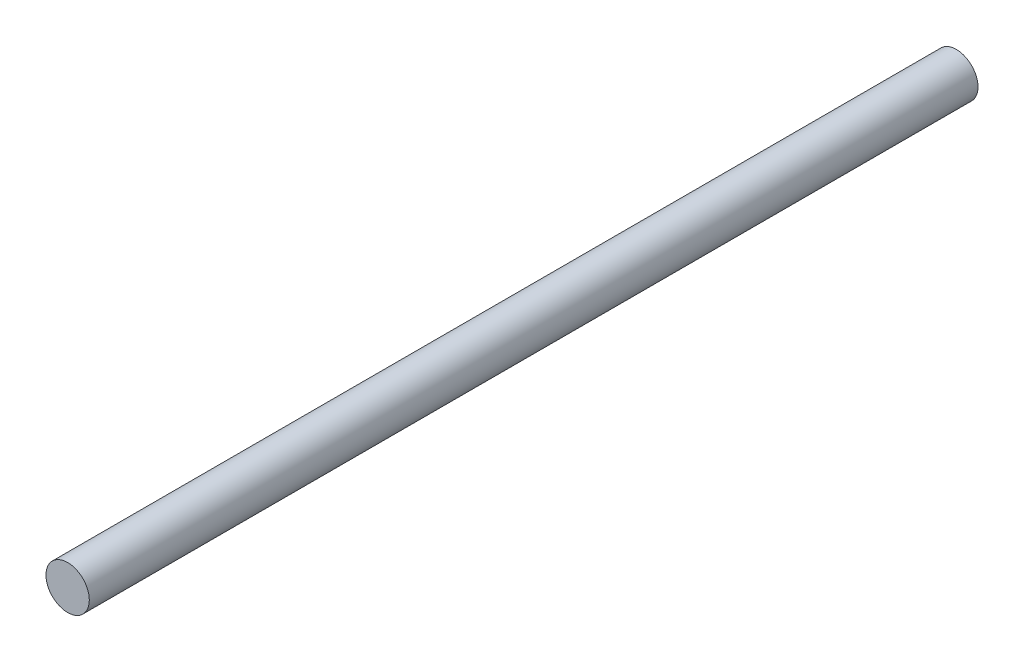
ISO-10303-21;
HEADER;
FILE_DESCRIPTION(('STEP AP214'),'2;1');
FILE_NAME('part.step','',(''),(''),'','','');
FILE_SCHEMA(('AUTOMOTIVE_DESIGN { 1 0 10303 214 1 1 1 1 }'));
ENDSEC;
DATA;
#1=APPLICATION_CONTEXT('core data for automotive mechanical design processes');
#2=APPLICATION_PROTOCOL_DEFINITION('international standard','automotive_design',2000,#1);
#3=PRODUCT_CONTEXT('',#1,'mechanical');
#4=PRODUCT('Part','Part','',(#3));
#5=PRODUCT_RELATED_PRODUCT_CATEGORY('part','',(#4));
#6=PRODUCT_DEFINITION_FORMATION('','',#4);
#7=PRODUCT_DEFINITION_CONTEXT('part definition',#1,'design');
#8=PRODUCT_DEFINITION('design','',#6,#7);
#9=PRODUCT_DEFINITION_SHAPE('','',#8);
#10=(LENGTH_UNIT() NAMED_UNIT(*) SI_UNIT(.MILLI.,.METRE.));
#11=(NAMED_UNIT(*) PLANE_ANGLE_UNIT() SI_UNIT($,.RADIAN.));
#12=(NAMED_UNIT(*) SI_UNIT($,.STERADIAN.) SOLID_ANGLE_UNIT());
#13=UNCERTAINTY_MEASURE_WITH_UNIT(LENGTH_MEASURE(1.E-05),#10,'distance_accuracy_value','');
#14=(GEOMETRIC_REPRESENTATION_CONTEXT(3) GLOBAL_UNCERTAINTY_ASSIGNED_CONTEXT((#13)) GLOBAL_UNIT_ASSIGNED_CONTEXT((#10,
#11,#12)) REPRESENTATION_CONTEXT('',''));
#15=CARTESIAN_POINT('',(0.,0.,0.));
#16=DIRECTION('',(0.,0.,1.));
#17=DIRECTION('',(1.,0.,0.));
#18=AXIS2_PLACEMENT_3D('',#15,#16,#17);
#19=CARTESIAN_POINT('',(0.,0.,41.));
#20=DIRECTION('',(0.,0.,-1.));
#21=DIRECTION('',(-1.,0.,0.));
#22=AXIS2_PLACEMENT_3D('',#19,#20,#21);
#23=CYLINDRICAL_SURFACE('',#22,1.);
#24=CARTESIAN_POINT('',(0.,0.,41.));
#25=DIRECTION('',(0.,0.,1.));
#26=DIRECTION('',(1.,0.,0.));
#27=AXIS2_PLACEMENT_3D('',#24,#25,#26);
#28=CIRCLE('',#27,1.);
#29=CARTESIAN_POINT('',(1.,0.,41.));
#30=VERTEX_POINT('',#29);
#31=EDGE_CURVE('E10',#30,#30,#28,.T.);
#32=ORIENTED_EDGE('',*,*,#31,.F.);
#33=EDGE_LOOP('',(#32));
#34=FACE_BOUND('',#33,.T.);
#35=CARTESIAN_POINT('',(0.,0.,0.));
#36=DIRECTION('',(0.,0.,1.));
#37=DIRECTION('',(1.,0.,0.));
#38=AXIS2_PLACEMENT_3D('',#35,#36,#37);
#39=CIRCLE('',#38,1.);
#40=CARTESIAN_POINT('',(1.,0.,0.));
#41=VERTEX_POINT('',#40);
#42=EDGE_CURVE('E38',#41,#41,#39,.T.);
#43=ORIENTED_EDGE('',*,*,#42,.T.);
#44=EDGE_LOOP('',(#43));
#45=FACE_BOUND('',#44,.T.);
#46=ADVANCED_FACE('F32',(#34,#45),#23,.T.);
#47=CARTESIAN_POINT('',(0.,0.,41.));
#48=DIRECTION('',(0.,0.,1.));
#49=DIRECTION('',(1.,0.,0.));
#50=AXIS2_PLACEMENT_3D('',#47,#48,#49);
#51=PLANE('',#50);
#52=ORIENTED_EDGE('',*,*,#31,.T.);
#53=EDGE_LOOP('',(#52));
#54=FACE_BOUND('',#53,.T.);
#55=ADVANCED_FACE('F47',(#54),#51,.T.);
#56=CARTESIAN_POINT('',(0.,0.,0.));
#57=DIRECTION('',(0.,0.,1.));
#58=DIRECTION('',(1.,0.,0.));
#59=AXIS2_PLACEMENT_3D('',#56,#57,#58);
#60=PLANE('',#59);
#61=ORIENTED_EDGE('',*,*,#42,.F.);
#62=EDGE_LOOP('',(#61));
#63=FACE_BOUND('',#62,.T.);
#64=ADVANCED_FACE('F45',(#63),#60,.F.);
#65=CLOSED_SHELL('',(#46,#55,#64));
#66=MANIFOLD_SOLID_BREP('B2',#65);
#67=ADVANCED_BREP_SHAPE_REPRESENTATION('',(#18,#66),#14);
#68=SHAPE_DEFINITION_REPRESENTATION(#9,#67);
ENDSEC;
END-ISO-10303-21;
